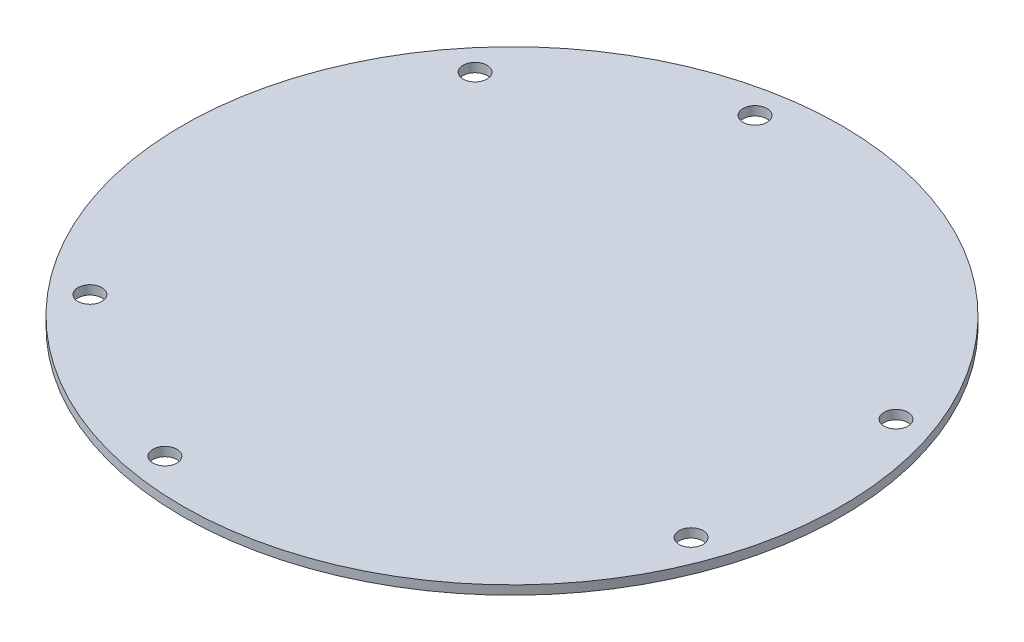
ISO-10303-21;
HEADER;
FILE_DESCRIPTION(('STEP AP214'),'2;1');
FILE_NAME('part.step','',(''),(''),'','','');
FILE_SCHEMA(('AUTOMOTIVE_DESIGN { 1 0 10303 214 1 1 1 1 }'));
ENDSEC;
DATA;
#1=APPLICATION_CONTEXT('core data for automotive mechanical design processes');
#2=APPLICATION_PROTOCOL_DEFINITION('international standard','automotive_design',2000,#1);
#3=PRODUCT_CONTEXT('',#1,'mechanical');
#4=PRODUCT('Part','Part','',(#3));
#5=PRODUCT_RELATED_PRODUCT_CATEGORY('part','',(#4));
#6=PRODUCT_DEFINITION_FORMATION('','',#4);
#7=PRODUCT_DEFINITION_CONTEXT('part definition',#1,'design');
#8=PRODUCT_DEFINITION('design','',#6,#7);
#9=PRODUCT_DEFINITION_SHAPE('','',#8);
#10=(LENGTH_UNIT() NAMED_UNIT(*) SI_UNIT(.MILLI.,.METRE.));
#11=(NAMED_UNIT(*) PLANE_ANGLE_UNIT() SI_UNIT($,.RADIAN.));
#12=(NAMED_UNIT(*) SI_UNIT($,.STERADIAN.) SOLID_ANGLE_UNIT());
#13=UNCERTAINTY_MEASURE_WITH_UNIT(LENGTH_MEASURE(1.E-05),#10,'distance_accuracy_value','');
#14=(GEOMETRIC_REPRESENTATION_CONTEXT(3) GLOBAL_UNCERTAINTY_ASSIGNED_CONTEXT((#13)) GLOBAL_UNIT_ASSIGNED_CONTEXT((#10,
#11,#12)) REPRESENTATION_CONTEXT('',''));
#15=CARTESIAN_POINT('',(0.,0.,0.));
#16=DIRECTION('',(0.,0.,1.));
#17=DIRECTION('',(1.,0.,0.));
#18=AXIS2_PLACEMENT_3D('',#15,#16,#17);
#19=CARTESIAN_POINT('',(0.,30.,0.));
#20=DIRECTION('',(0.,1.,0.));
#21=DIRECTION('',(0.,0.,1.));
#22=AXIS2_PLACEMENT_3D('',#19,#20,#21);
#23=PLANE('',#22);
#24=CARTESIAN_POINT('',(-766.044443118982,30.,642.787609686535));
#25=DIRECTION('',(0.,1.,0.));
#26=DIRECTION('',(0.866025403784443,0.,-0.499999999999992));
#27=AXIS2_PLACEMENT_3D('',#24,#25,#26);
#28=CIRCLE('',#27,40.);
#29=CARTESIAN_POINT('',(-731.403426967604,30.,622.787609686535));
#30=VERTEX_POINT('',#29);
#31=EDGE_CURVE('E75',#30,#30,#28,.T.);
#32=ORIENTED_EDGE('',*,*,#31,.F.);
#33=EDGE_LOOP('',(#32));
#34=FACE_BOUND('',#33,.T.);
#35=CARTESIAN_POINT('',(939.692620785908,30.,342.02014332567));
#36=DIRECTION('',(0.,1.,0.));
#37=DIRECTION('',(-0.866025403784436,0.,-0.500000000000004));
#38=AXIS2_PLACEMENT_3D('',#35,#36,#37);
#39=CIRCLE('',#38,40.);
#40=CARTESIAN_POINT('',(905.051604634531,30.,322.02014332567));
#41=VERTEX_POINT('',#40);
#42=EDGE_CURVE('E69',#41,#41,#39,.T.);
#43=ORIENTED_EDGE('',*,*,#42,.F.);
#44=EDGE_LOOP('',(#43));
#45=FACE_BOUND('',#44,.T.);
#46=CARTESIAN_POINT('',(-173.648177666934,30.,-984.807753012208));
#47=DIRECTION('',(0.,1.,0.));
#48=DIRECTION('',(0.,0.,1.));
#49=AXIS2_PLACEMENT_3D('',#46,#47,#48);
#50=CIRCLE('',#49,40.);
#51=CARTESIAN_POINT('',(-173.648177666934,30.,-944.807753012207));
#52=VERTEX_POINT('',#51);
#53=EDGE_CURVE('E63',#52,#52,#50,.T.);
#54=ORIENTED_EDGE('',*,*,#53,.F.);
#55=EDGE_LOOP('',(#54));
#56=FACE_BOUND('',#55,.T.);
#57=CARTESIAN_POINT('',(-766.044443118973,30.,-642.787609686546));
#58=DIRECTION('',(0.,1.,0.));
#59=DIRECTION('',(0.866025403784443,0.,-0.499999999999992));
#60=AXIS2_PLACEMENT_3D('',#57,#58,#59);
#61=CIRCLE('',#60,39.9999999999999);
#62=CARTESIAN_POINT('',(-731.403426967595,30.,-662.787609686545));
#63=VERTEX_POINT('',#62);
#64=EDGE_CURVE('E57',#63,#63,#61,.T.);
#65=ORIENTED_EDGE('',*,*,#64,.F.);
#66=EDGE_LOOP('',(#65));
#67=FACE_BOUND('',#66,.T.);
#68=CARTESIAN_POINT('',(-173.648177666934,30.,984.807753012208));
#69=DIRECTION('',(0.,1.,0.));
#70=DIRECTION('',(-0.866025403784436,0.,-0.500000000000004));
#71=AXIS2_PLACEMENT_3D('',#68,#69,#70);
#72=CIRCLE('',#71,39.9999999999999);
#73=CARTESIAN_POINT('',(-208.289193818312,30.,964.807753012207));
#74=VERTEX_POINT('',#73);
#75=EDGE_CURVE('E51',#74,#74,#72,.T.);
#76=ORIENTED_EDGE('',*,*,#75,.F.);
#77=EDGE_LOOP('',(#76));
#78=FACE_BOUND('',#77,.T.);
#79=CARTESIAN_POINT('',(939.692620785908,30.,-342.020143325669));
#80=DIRECTION('',(0.,1.,0.));
#81=DIRECTION('',(0.,0.,1.));
#82=AXIS2_PLACEMENT_3D('',#79,#80,#81);
#83=CIRCLE('',#82,39.9999999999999);
#84=CARTESIAN_POINT('',(939.692620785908,30.,-302.020143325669));
#85=VERTEX_POINT('',#84);
#86=EDGE_CURVE('E45',#85,#85,#83,.T.);
#87=ORIENTED_EDGE('',*,*,#86,.F.);
#88=EDGE_LOOP('',(#87));
#89=FACE_BOUND('',#88,.T.);
#90=CARTESIAN_POINT('',(0.,30.,0.));
#91=DIRECTION('',(0.,-1.,0.));
#92=DIRECTION('',(0.,0.,-1.));
#93=AXIS2_PLACEMENT_3D('',#90,#91,#92);
#94=CIRCLE('',#93,1100.);
#95=CARTESIAN_POINT('',(0.,30.,-1100.));
#96=VERTEX_POINT('',#95);
#97=EDGE_CURVE('E10',#96,#96,#94,.T.);
#98=ORIENTED_EDGE('',*,*,#97,.F.);
#99=EDGE_LOOP('',(#98));
#100=FACE_BOUND('',#99,.T.);
#101=ADVANCED_FACE('F31',(#34,#45,#56,#67,#78,#89,#100),#23,.T.);
#102=CARTESIAN_POINT('',(0.,-34.9782122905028,0.));
#103=DIRECTION('',(0.,-1.,0.));
#104=DIRECTION('',(0.,0.,-1.));
#105=AXIS2_PLACEMENT_3D('',#102,#103,#104);
#106=CYLINDRICAL_SURFACE('',#105,1100.);
#107=ORIENTED_EDGE('',*,*,#97,.T.);
#108=EDGE_LOOP('',(#107));
#109=FACE_BOUND('',#108,.T.);
#110=CARTESIAN_POINT('',(0.,0.,0.));
#111=DIRECTION('',(0.,-1.,0.));
#112=DIRECTION('',(0.,0.,-1.));
#113=AXIS2_PLACEMENT_3D('',#110,#111,#112);
#114=CIRCLE('',#113,1100.);
#115=CARTESIAN_POINT('',(0.,0.,-1100.));
#116=VERTEX_POINT('',#115);
#117=EDGE_CURVE('E37',#116,#116,#114,.T.);
#118=ORIENTED_EDGE('',*,*,#117,.F.);
#119=EDGE_LOOP('',(#118));
#120=FACE_BOUND('',#119,.T.);
#121=ADVANCED_FACE('F93',(#109,#120),#106,.T.);
#122=CARTESIAN_POINT('',(0.,0.,0.));
#123=DIRECTION('',(0.,-1.,0.));
#124=DIRECTION('',(0.,0.,-1.));
#125=AXIS2_PLACEMENT_3D('',#122,#123,#124);
#126=PLANE('',#125);
#127=CARTESIAN_POINT('',(-766.044443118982,0.,642.787609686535));
#128=DIRECTION('',(0.,1.,0.));
#129=DIRECTION('',(0.866025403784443,0.,-0.499999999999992));
#130=AXIS2_PLACEMENT_3D('',#127,#128,#129);
#131=CIRCLE('',#130,40.);
#132=CARTESIAN_POINT('',(-731.403426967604,0.,622.787609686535));
#133=VERTEX_POINT('',#132);
#134=EDGE_CURVE('E72',#133,#133,#131,.T.);
#135=ORIENTED_EDGE('',*,*,#134,.T.);
#136=EDGE_LOOP('',(#135));
#137=FACE_BOUND('',#136,.T.);
#138=CARTESIAN_POINT('',(939.692620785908,0.,342.02014332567));
#139=DIRECTION('',(0.,1.,0.));
#140=DIRECTION('',(-0.866025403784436,0.,-0.500000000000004));
#141=AXIS2_PLACEMENT_3D('',#138,#139,#140);
#142=CIRCLE('',#141,40.);
#143=CARTESIAN_POINT('',(905.051604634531,0.,322.02014332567));
#144=VERTEX_POINT('',#143);
#145=EDGE_CURVE('E66',#144,#144,#142,.T.);
#146=ORIENTED_EDGE('',*,*,#145,.T.);
#147=EDGE_LOOP('',(#146));
#148=FACE_BOUND('',#147,.T.);
#149=CARTESIAN_POINT('',(-173.648177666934,0.,-984.807753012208));
#150=DIRECTION('',(0.,1.,0.));
#151=DIRECTION('',(0.,0.,1.));
#152=AXIS2_PLACEMENT_3D('',#149,#150,#151);
#153=CIRCLE('',#152,40.);
#154=CARTESIAN_POINT('',(-173.648177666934,0.,-944.807753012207));
#155=VERTEX_POINT('',#154);
#156=EDGE_CURVE('E60',#155,#155,#153,.T.);
#157=ORIENTED_EDGE('',*,*,#156,.T.);
#158=EDGE_LOOP('',(#157));
#159=FACE_BOUND('',#158,.T.);
#160=CARTESIAN_POINT('',(-766.044443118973,0.,-642.787609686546));
#161=DIRECTION('',(0.,1.,0.));
#162=DIRECTION('',(0.866025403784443,0.,-0.499999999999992));
#163=AXIS2_PLACEMENT_3D('',#160,#161,#162);
#164=CIRCLE('',#163,39.9999999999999);
#165=CARTESIAN_POINT('',(-731.403426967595,0.,-662.787609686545));
#166=VERTEX_POINT('',#165);
#167=EDGE_CURVE('E54',#166,#166,#164,.T.);
#168=ORIENTED_EDGE('',*,*,#167,.T.);
#169=EDGE_LOOP('',(#168));
#170=FACE_BOUND('',#169,.T.);
#171=CARTESIAN_POINT('',(-173.648177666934,0.,984.807753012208));
#172=DIRECTION('',(0.,1.,0.));
#173=DIRECTION('',(-0.866025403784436,0.,-0.500000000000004));
#174=AXIS2_PLACEMENT_3D('',#171,#172,#173);
#175=CIRCLE('',#174,39.9999999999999);
#176=CARTESIAN_POINT('',(-208.289193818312,0.,964.807753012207));
#177=VERTEX_POINT('',#176);
#178=EDGE_CURVE('E49',#177,#177,#175,.T.);
#179=ORIENTED_EDGE('',*,*,#178,.T.);
#180=EDGE_LOOP('',(#179));
#181=FACE_BOUND('',#180,.T.);
#182=CARTESIAN_POINT('',(939.692620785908,0.,-342.020143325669));
#183=DIRECTION('',(0.,1.,0.));
#184=DIRECTION('',(0.,0.,1.));
#185=AXIS2_PLACEMENT_3D('',#182,#183,#184);
#186=CIRCLE('',#185,39.9999999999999);
#187=CARTESIAN_POINT('',(939.692620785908,0.,-302.020143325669));
#188=VERTEX_POINT('',#187);
#189=EDGE_CURVE('E41',#188,#188,#186,.T.);
#190=ORIENTED_EDGE('',*,*,#189,.T.);
#191=EDGE_LOOP('',(#190));
#192=FACE_BOUND('',#191,.T.);
#193=ORIENTED_EDGE('',*,*,#117,.T.);
#194=EDGE_LOOP('',(#193));
#195=FACE_BOUND('',#194,.T.);
#196=ADVANCED_FACE('F81',(#137,#148,#159,#170,#181,#192,#195),#126,.T.);
#197=CARTESIAN_POINT('',(939.692620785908,0.,-342.020143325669));
#198=DIRECTION('',(0.,1.,0.));
#199=DIRECTION('',(0.,0.,1.));
#200=AXIS2_PLACEMENT_3D('',#197,#198,#199);
#201=CYLINDRICAL_SURFACE('',#200,39.9999999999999);
#202=ORIENTED_EDGE('',*,*,#189,.F.);
#203=EDGE_LOOP('',(#202));
#204=FACE_BOUND('',#203,.T.);
#205=ORIENTED_EDGE('',*,*,#86,.T.);
#206=EDGE_LOOP('',(#205));
#207=FACE_BOUND('',#206,.T.);
#208=ADVANCED_FACE('F105',(#204,#207),#201,.F.);
#209=CARTESIAN_POINT('',(-173.648177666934,0.,984.807753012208));
#210=DIRECTION('',(0.,1.,0.));
#211=DIRECTION('',(0.,0.,1.));
#212=AXIS2_PLACEMENT_3D('',#209,#210,#211);
#213=CYLINDRICAL_SURFACE('',#212,39.9999999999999);
#214=ORIENTED_EDGE('',*,*,#178,.F.);
#215=EDGE_LOOP('',(#214));
#216=FACE_BOUND('',#215,.T.);
#217=ORIENTED_EDGE('',*,*,#75,.T.);
#218=EDGE_LOOP('',(#217));
#219=FACE_BOUND('',#218,.T.);
#220=ADVANCED_FACE('F107',(#216,#219),#213,.F.);
#221=CARTESIAN_POINT('',(-766.044443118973,0.,-642.787609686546));
#222=DIRECTION('',(0.,1.,0.));
#223=DIRECTION('',(0.,0.,1.));
#224=AXIS2_PLACEMENT_3D('',#221,#222,#223);
#225=CYLINDRICAL_SURFACE('',#224,39.9999999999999);
#226=ORIENTED_EDGE('',*,*,#167,.F.);
#227=EDGE_LOOP('',(#226));
#228=FACE_BOUND('',#227,.T.);
#229=ORIENTED_EDGE('',*,*,#64,.T.);
#230=EDGE_LOOP('',(#229));
#231=FACE_BOUND('',#230,.T.);
#232=ADVANCED_FACE('F114',(#228,#231),#225,.F.);
#233=CARTESIAN_POINT('',(-173.648177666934,0.,-984.807753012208));
#234=DIRECTION('',(0.,1.,0.));
#235=DIRECTION('',(0.,0.,1.));
#236=AXIS2_PLACEMENT_3D('',#233,#234,#235);
#237=CYLINDRICAL_SURFACE('',#236,40.);
#238=ORIENTED_EDGE('',*,*,#156,.F.);
#239=EDGE_LOOP('',(#238));
#240=FACE_BOUND('',#239,.T.);
#241=ORIENTED_EDGE('',*,*,#53,.T.);
#242=EDGE_LOOP('',(#241));
#243=FACE_BOUND('',#242,.T.);
#244=ADVANCED_FACE('F143',(#240,#243),#237,.F.);
#245=CARTESIAN_POINT('',(939.692620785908,0.,342.02014332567));
#246=DIRECTION('',(0.,1.,0.));
#247=DIRECTION('',(0.,0.,1.));
#248=AXIS2_PLACEMENT_3D('',#245,#246,#247);
#249=CYLINDRICAL_SURFACE('',#248,40.);
#250=ORIENTED_EDGE('',*,*,#145,.F.);
#251=EDGE_LOOP('',(#250));
#252=FACE_BOUND('',#251,.T.);
#253=ORIENTED_EDGE('',*,*,#42,.T.);
#254=EDGE_LOOP('',(#253));
#255=FACE_BOUND('',#254,.T.);
#256=ADVANCED_FACE('F87',(#252,#255),#249,.F.);
#257=CARTESIAN_POINT('',(-766.044443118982,0.,642.787609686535));
#258=DIRECTION('',(0.,1.,0.));
#259=DIRECTION('',(0.,0.,1.));
#260=AXIS2_PLACEMENT_3D('',#257,#258,#259);
#261=CYLINDRICAL_SURFACE('',#260,40.);
#262=ORIENTED_EDGE('',*,*,#134,.F.);
#263=EDGE_LOOP('',(#262));
#264=FACE_BOUND('',#263,.T.);
#265=ORIENTED_EDGE('',*,*,#31,.T.);
#266=EDGE_LOOP('',(#265));
#267=FACE_BOUND('',#266,.T.);
#268=ADVANCED_FACE('F84',(#264,#267),#261,.F.);
#269=CLOSED_SHELL('',(#101,#121,#196,#208,#220,#232,#244,#256,#268));
#270=MANIFOLD_SOLID_BREP('B2',#269);
#271=ADVANCED_BREP_SHAPE_REPRESENTATION('',(#18,#270),#14);
#272=SHAPE_DEFINITION_REPRESENTATION(#9,#271);
ENDSEC;
END-ISO-10303-21;
